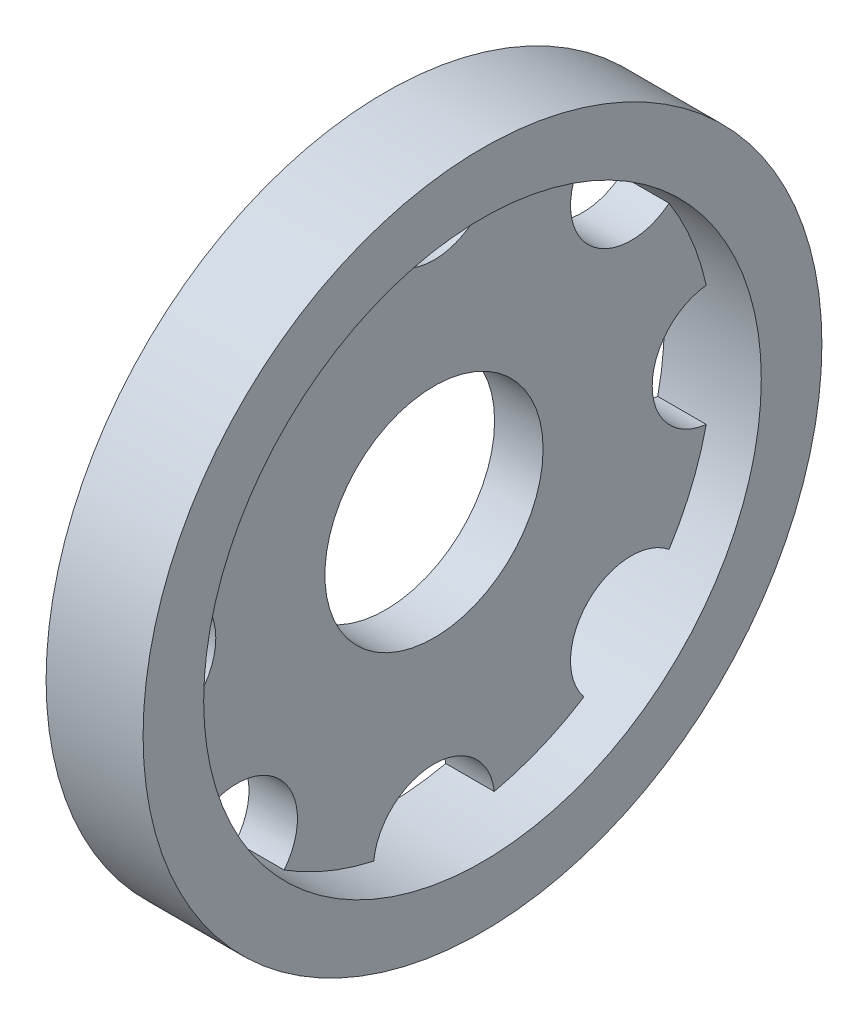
ISO-10303-21;
HEADER;
FILE_DESCRIPTION(('STEP AP214'),'2;1');
FILE_NAME('part.step','',(''),(''),'','','');
FILE_SCHEMA(('AUTOMOTIVE_DESIGN { 1 0 10303 214 1 1 1 1 }'));
ENDSEC;
DATA;
#1=APPLICATION_CONTEXT('core data for automotive mechanical design processes');
#2=APPLICATION_PROTOCOL_DEFINITION('international standard','automotive_design',2000,#1);
#3=PRODUCT_CONTEXT('',#1,'mechanical');
#4=PRODUCT('Part','Part','',(#3));
#5=PRODUCT_RELATED_PRODUCT_CATEGORY('part','',(#4));
#6=PRODUCT_DEFINITION_FORMATION('','',#4);
#7=PRODUCT_DEFINITION_CONTEXT('part definition',#1,'design');
#8=PRODUCT_DEFINITION('design','',#6,#7);
#9=PRODUCT_DEFINITION_SHAPE('','',#8);
#10=(LENGTH_UNIT() NAMED_UNIT(*) SI_UNIT(.MILLI.,.METRE.));
#11=(NAMED_UNIT(*) PLANE_ANGLE_UNIT() SI_UNIT($,.RADIAN.));
#12=(NAMED_UNIT(*) SI_UNIT($,.STERADIAN.) SOLID_ANGLE_UNIT());
#13=UNCERTAINTY_MEASURE_WITH_UNIT(LENGTH_MEASURE(1.E-05),#10,'distance_accuracy_value','');
#14=(GEOMETRIC_REPRESENTATION_CONTEXT(3) GLOBAL_UNCERTAINTY_ASSIGNED_CONTEXT((#13)) GLOBAL_UNIT_ASSIGNED_CONTEXT((#10,
#11,#12)) REPRESENTATION_CONTEXT('',''));
#15=CARTESIAN_POINT('',(0.,0.,0.));
#16=DIRECTION('',(0.,0.,1.));
#17=DIRECTION('',(1.,0.,0.));
#18=AXIS2_PLACEMENT_3D('',#15,#16,#17);
#19=CARTESIAN_POINT('',(2.,8.13172798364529,8.1317279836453));
#20=DIRECTION('',(-1.,0.,0.));
#21=DIRECTION('',(0.,0.,1.));
#22=AXIS2_PLACEMENT_3D('',#19,#20,#21);
#23=CYLINDRICAL_SURFACE('',#22,2.5);
#24=CARTESIAN_POINT('',(0.,8.13172798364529,8.1317279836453));
#25=DIRECTION('',(1.,0.,0.));
#26=DIRECTION('',(0.,0.,-1.));
#27=AXIS2_PLACEMENT_3D('',#24,#25,#26);
#28=CIRCLE('',#27,2.5);
#29=CARTESIAN_POINT('',(0.,6.18228633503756,9.69687246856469));
#30=VERTEX_POINT('',#29);
#31=CARTESIAN_POINT('',(0.,9.69687246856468,6.18228633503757));
#32=VERTEX_POINT('',#31);
#33=EDGE_CURVE('E226',#30,#32,#28,.T.);
#34=ORIENTED_EDGE('',*,*,#33,.F.);
#35=DIRECTION('',(-1.,0.,0.));
#36=VECTOR('',#35,1.);
#37=CARTESIAN_POINT('',(2.,6.18228633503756,9.69687246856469));
#38=LINE('',#37,#36);
#39=CARTESIAN_POINT('',(2.,6.18228633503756,9.69687246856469));
#40=VERTEX_POINT('',#39);
#41=EDGE_CURVE('E11',#40,#30,#38,.T.);
#42=ORIENTED_EDGE('',*,*,#41,.F.);
#43=CARTESIAN_POINT('',(2.,8.13172798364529,8.1317279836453));
#44=DIRECTION('',(1.,0.,0.));
#45=DIRECTION('',(0.,0.,-1.));
#46=AXIS2_PLACEMENT_3D('',#43,#44,#45);
#47=CIRCLE('',#46,2.5);
#48=CARTESIAN_POINT('',(2.,9.69687246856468,6.18228633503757));
#49=VERTEX_POINT('',#48);
#50=EDGE_CURVE('E230',#40,#49,#47,.T.);
#51=ORIENTED_EDGE('',*,*,#50,.T.);
#52=DIRECTION('',(-1.,0.,0.));
#53=VECTOR('',#52,1.);
#54=CARTESIAN_POINT('',(2.,9.69687246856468,6.18228633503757));
#55=LINE('',#54,#53);
#56=EDGE_CURVE('E160',#49,#32,#55,.T.);
#57=ORIENTED_EDGE('',*,*,#56,.T.);
#58=EDGE_LOOP('',(#34,#42,#51,#57));
#59=FACE_BOUND('',#58,.T.);
#60=ADVANCED_FACE('F35',(#59),#23,.F.);
#61=CARTESIAN_POINT('',(2.,0.,11.5));
#62=DIRECTION('',(-1.,0.,0.));
#63=DIRECTION('',(0.,0.,1.));
#64=AXIS2_PLACEMENT_3D('',#61,#62,#63);
#65=CYLINDRICAL_SURFACE('',#64,2.5);
#66=CARTESIAN_POINT('',(0.,0.,11.5));
#67=DIRECTION('',(1.,0.,0.));
#68=DIRECTION('',(0.,0.,-1.));
#69=AXIS2_PLACEMENT_3D('',#66,#67,#68);
#70=CIRCLE('',#69,2.5);
#71=CARTESIAN_POINT('',(0.,-2.48518768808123,11.2282608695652));
#72=VERTEX_POINT('',#71);
#73=CARTESIAN_POINT('',(0.,2.48518768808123,11.2282608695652));
#74=VERTEX_POINT('',#73);
#75=EDGE_CURVE('E199',#72,#74,#70,.T.);
#76=ORIENTED_EDGE('',*,*,#75,.F.);
#77=DIRECTION('',(-1.,0.,0.));
#78=VECTOR('',#77,1.);
#79=CARTESIAN_POINT('',(2.,-2.48518768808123,11.2282608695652));
#80=LINE('',#79,#78);
#81=CARTESIAN_POINT('',(2.,-2.48518768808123,11.2282608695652));
#82=VERTEX_POINT('',#81);
#83=EDGE_CURVE('E189',#82,#72,#80,.T.);
#84=ORIENTED_EDGE('',*,*,#83,.F.);
#85=CARTESIAN_POINT('',(2.,0.,11.5));
#86=DIRECTION('',(1.,0.,0.));
#87=DIRECTION('',(0.,0.,-1.));
#88=AXIS2_PLACEMENT_3D('',#85,#86,#87);
#89=CIRCLE('',#88,2.5);
#90=CARTESIAN_POINT('',(2.,2.48518768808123,11.2282608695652));
#91=VERTEX_POINT('',#90);
#92=EDGE_CURVE('E201',#82,#91,#89,.T.);
#93=ORIENTED_EDGE('',*,*,#92,.T.);
#94=DIRECTION('',(-1.,0.,0.));
#95=VECTOR('',#94,1.);
#96=CARTESIAN_POINT('',(2.,2.48518768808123,11.2282608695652));
#97=LINE('',#96,#95);
#98=EDGE_CURVE('E43',#91,#74,#97,.T.);
#99=ORIENTED_EDGE('',*,*,#98,.T.);
#100=EDGE_LOOP('',(#76,#84,#93,#99));
#101=FACE_BOUND('',#100,.T.);
#102=ADVANCED_FACE('F197',(#101),#65,.F.);
#103=CARTESIAN_POINT('',(2.,-8.1317279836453,8.13172798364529));
#104=DIRECTION('',(-1.,0.,0.));
#105=DIRECTION('',(0.,0.,1.));
#106=AXIS2_PLACEMENT_3D('',#103,#104,#105);
#107=CYLINDRICAL_SURFACE('',#106,2.5);
#108=CARTESIAN_POINT('',(0.,-8.1317279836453,8.13172798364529));
#109=DIRECTION('',(1.,0.,0.));
#110=DIRECTION('',(0.,0.,-1.));
#111=AXIS2_PLACEMENT_3D('',#108,#109,#110);
#112=CIRCLE('',#111,2.5);
#113=CARTESIAN_POINT('',(0.,-9.69687246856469,6.18228633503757));
#114=VERTEX_POINT('',#113);
#115=CARTESIAN_POINT('',(0.,-6.18228633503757,9.69687246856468));
#116=VERTEX_POINT('',#115);
#117=EDGE_CURVE('E258',#114,#116,#112,.T.);
#118=ORIENTED_EDGE('',*,*,#117,.F.);
#119=DIRECTION('',(-1.,0.,0.));
#120=VECTOR('',#119,1.);
#121=CARTESIAN_POINT('',(2.,-9.69687246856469,6.18228633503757));
#122=LINE('',#121,#120);
#123=CARTESIAN_POINT('',(2.,-9.69687246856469,6.18228633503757));
#124=VERTEX_POINT('',#123);
#125=EDGE_CURVE('E183',#124,#114,#122,.T.);
#126=ORIENTED_EDGE('',*,*,#125,.F.);
#127=CARTESIAN_POINT('',(2.,-8.1317279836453,8.13172798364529));
#128=DIRECTION('',(1.,0.,0.));
#129=DIRECTION('',(0.,0.,-1.));
#130=AXIS2_PLACEMENT_3D('',#127,#128,#129);
#131=CIRCLE('',#130,2.5);
#132=CARTESIAN_POINT('',(2.,-6.18228633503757,9.69687246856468));
#133=VERTEX_POINT('',#132);
#134=EDGE_CURVE('E236',#124,#133,#131,.T.);
#135=ORIENTED_EDGE('',*,*,#134,.T.);
#136=DIRECTION('',(-1.,0.,0.));
#137=VECTOR('',#136,1.);
#138=CARTESIAN_POINT('',(2.,-6.18228633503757,9.69687246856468));
#139=LINE('',#138,#137);
#140=EDGE_CURVE('E186',#133,#116,#139,.T.);
#141=ORIENTED_EDGE('',*,*,#140,.T.);
#142=EDGE_LOOP('',(#118,#126,#135,#141));
#143=FACE_BOUND('',#142,.T.);
#144=ADVANCED_FACE('F309',(#143),#107,.F.);
#145=CARTESIAN_POINT('',(2.,-11.5,0.));
#146=DIRECTION('',(-1.,0.,0.));
#147=DIRECTION('',(0.,0.,1.));
#148=AXIS2_PLACEMENT_3D('',#145,#146,#147);
#149=CYLINDRICAL_SURFACE('',#148,2.5);
#150=CARTESIAN_POINT('',(0.,-11.5,0.));
#151=DIRECTION('',(1.,0.,0.));
#152=DIRECTION('',(0.,0.,-1.));
#153=AXIS2_PLACEMENT_3D('',#150,#151,#152);
#154=CIRCLE('',#153,2.5);
#155=CARTESIAN_POINT('',(0.,-11.2282608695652,-2.48518768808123));
#156=VERTEX_POINT('',#155);
#157=CARTESIAN_POINT('',(0.,-11.2282608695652,2.48518768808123));
#158=VERTEX_POINT('',#157);
#159=EDGE_CURVE('E261',#156,#158,#154,.T.);
#160=ORIENTED_EDGE('',*,*,#159,.F.);
#161=DIRECTION('',(-1.,0.,0.));
#162=VECTOR('',#161,1.);
#163=CARTESIAN_POINT('',(2.,-11.2282608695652,-2.48518768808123));
#164=LINE('',#163,#162);
#165=CARTESIAN_POINT('',(2.,-11.2282608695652,-2.48518768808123));
#166=VERTEX_POINT('',#165);
#167=EDGE_CURVE('E177',#166,#156,#164,.T.);
#168=ORIENTED_EDGE('',*,*,#167,.F.);
#169=CARTESIAN_POINT('',(2.,-11.5,0.));
#170=DIRECTION('',(1.,0.,0.));
#171=DIRECTION('',(0.,0.,-1.));
#172=AXIS2_PLACEMENT_3D('',#169,#170,#171);
#173=CIRCLE('',#172,2.5);
#174=CARTESIAN_POINT('',(2.,-11.2282608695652,2.48518768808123));
#175=VERTEX_POINT('',#174);
#176=EDGE_CURVE('E240',#166,#175,#173,.T.);
#177=ORIENTED_EDGE('',*,*,#176,.T.);
#178=DIRECTION('',(-1.,0.,0.));
#179=VECTOR('',#178,1.);
#180=CARTESIAN_POINT('',(2.,-11.2282608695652,2.48518768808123));
#181=LINE('',#180,#179);
#182=EDGE_CURVE('E180',#175,#158,#181,.T.);
#183=ORIENTED_EDGE('',*,*,#182,.T.);
#184=EDGE_LOOP('',(#160,#168,#177,#183));
#185=FACE_BOUND('',#184,.T.);
#186=ADVANCED_FACE('F313',(#185),#149,.F.);
#187=CARTESIAN_POINT('',(2.,-8.13172798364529,-8.1317279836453));
#188=DIRECTION('',(-1.,0.,0.));
#189=DIRECTION('',(0.,0.,1.));
#190=AXIS2_PLACEMENT_3D('',#187,#188,#189);
#191=CYLINDRICAL_SURFACE('',#190,2.5);
#192=CARTESIAN_POINT('',(0.,-8.13172798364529,-8.1317279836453));
#193=DIRECTION('',(1.,0.,0.));
#194=DIRECTION('',(0.,0.,-1.));
#195=AXIS2_PLACEMENT_3D('',#192,#193,#194);
#196=CIRCLE('',#195,2.5);
#197=CARTESIAN_POINT('',(0.,-6.18228633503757,-9.69687246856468));
#198=VERTEX_POINT('',#197);
#199=CARTESIAN_POINT('',(0.,-9.69687246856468,-6.18228633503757));
#200=VERTEX_POINT('',#199);
#201=EDGE_CURVE('E264',#198,#200,#196,.T.);
#202=ORIENTED_EDGE('',*,*,#201,.F.);
#203=DIRECTION('',(-1.,0.,0.));
#204=VECTOR('',#203,1.);
#205=CARTESIAN_POINT('',(2.,-6.18228633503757,-9.69687246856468));
#206=LINE('',#205,#204);
#207=CARTESIAN_POINT('',(2.,-6.18228633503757,-9.69687246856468));
#208=VERTEX_POINT('',#207);
#209=EDGE_CURVE('E171',#208,#198,#206,.T.);
#210=ORIENTED_EDGE('',*,*,#209,.F.);
#211=CARTESIAN_POINT('',(2.,-8.13172798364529,-8.1317279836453));
#212=DIRECTION('',(1.,0.,0.));
#213=DIRECTION('',(0.,0.,-1.));
#214=AXIS2_PLACEMENT_3D('',#211,#212,#213);
#215=CIRCLE('',#214,2.5);
#216=CARTESIAN_POINT('',(2.,-9.69687246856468,-6.18228633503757));
#217=VERTEX_POINT('',#216);
#218=EDGE_CURVE('E244',#208,#217,#215,.T.);
#219=ORIENTED_EDGE('',*,*,#218,.T.);
#220=DIRECTION('',(-1.,0.,0.));
#221=VECTOR('',#220,1.);
#222=CARTESIAN_POINT('',(2.,-9.69687246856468,-6.18228633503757));
#223=LINE('',#222,#221);
#224=EDGE_CURVE('E174',#217,#200,#223,.T.);
#225=ORIENTED_EDGE('',*,*,#224,.T.);
#226=EDGE_LOOP('',(#202,#210,#219,#225));
#227=FACE_BOUND('',#226,.T.);
#228=ADVANCED_FACE('F319',(#227),#191,.F.);
#229=CARTESIAN_POINT('',(2.,0.,-11.5));
#230=DIRECTION('',(-1.,0.,0.));
#231=DIRECTION('',(0.,0.,1.));
#232=AXIS2_PLACEMENT_3D('',#229,#230,#231);
#233=CYLINDRICAL_SURFACE('',#232,2.5);
#234=CARTESIAN_POINT('',(0.,0.,-11.5));
#235=DIRECTION('',(1.,0.,0.));
#236=DIRECTION('',(0.,0.,-1.));
#237=AXIS2_PLACEMENT_3D('',#234,#235,#236);
#238=CIRCLE('',#237,2.5);
#239=CARTESIAN_POINT('',(0.,2.48518768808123,-11.2282608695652));
#240=VERTEX_POINT('',#239);
#241=CARTESIAN_POINT('',(0.,-2.48518768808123,-11.2282608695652));
#242=VERTEX_POINT('',#241);
#243=EDGE_CURVE('E267',#240,#242,#238,.T.);
#244=ORIENTED_EDGE('',*,*,#243,.F.);
#245=DIRECTION('',(-1.,0.,0.));
#246=VECTOR('',#245,1.);
#247=CARTESIAN_POINT('',(2.,2.48518768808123,-11.2282608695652));
#248=LINE('',#247,#246);
#249=CARTESIAN_POINT('',(2.,2.48518768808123,-11.2282608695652));
#250=VERTEX_POINT('',#249);
#251=EDGE_CURVE('E165',#250,#240,#248,.T.);
#252=ORIENTED_EDGE('',*,*,#251,.F.);
#253=CARTESIAN_POINT('',(2.,0.,-11.5));
#254=DIRECTION('',(1.,0.,0.));
#255=DIRECTION('',(0.,0.,-1.));
#256=AXIS2_PLACEMENT_3D('',#253,#254,#255);
#257=CIRCLE('',#256,2.5);
#258=CARTESIAN_POINT('',(2.,-2.48518768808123,-11.2282608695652));
#259=VERTEX_POINT('',#258);
#260=EDGE_CURVE('E248',#250,#259,#257,.T.);
#261=ORIENTED_EDGE('',*,*,#260,.T.);
#262=DIRECTION('',(-1.,0.,0.));
#263=VECTOR('',#262,1.);
#264=CARTESIAN_POINT('',(2.,-2.48518768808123,-11.2282608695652));
#265=LINE('',#264,#263);
#266=EDGE_CURVE('E168',#259,#242,#265,.T.);
#267=ORIENTED_EDGE('',*,*,#266,.T.);
#268=EDGE_LOOP('',(#244,#252,#261,#267));
#269=FACE_BOUND('',#268,.T.);
#270=ADVANCED_FACE('F323',(#269),#233,.F.);
#271=CARTESIAN_POINT('',(2.,8.1317279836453,-8.13172798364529));
#272=DIRECTION('',(-1.,0.,0.));
#273=DIRECTION('',(0.,0.,1.));
#274=AXIS2_PLACEMENT_3D('',#271,#272,#273);
#275=CYLINDRICAL_SURFACE('',#274,2.5);
#276=CARTESIAN_POINT('',(0.,8.1317279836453,-8.13172798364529));
#277=DIRECTION('',(1.,0.,0.));
#278=DIRECTION('',(0.,0.,-1.));
#279=AXIS2_PLACEMENT_3D('',#276,#277,#278);
#280=CIRCLE('',#279,2.5);
#281=CARTESIAN_POINT('',(0.,9.69687246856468,-6.18228633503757));
#282=VERTEX_POINT('',#281);
#283=CARTESIAN_POINT('',(0.,6.18228633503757,-9.69687246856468));
#284=VERTEX_POINT('',#283);
#285=EDGE_CURVE('E82',#282,#284,#280,.T.);
#286=ORIENTED_EDGE('',*,*,#285,.F.);
#287=DIRECTION('',(-1.,0.,0.));
#288=VECTOR('',#287,1.);
#289=CARTESIAN_POINT('',(2.,9.69687246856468,-6.18228633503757));
#290=LINE('',#289,#288);
#291=CARTESIAN_POINT('',(2.,9.69687246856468,-6.18228633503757));
#292=VERTEX_POINT('',#291);
#293=EDGE_CURVE('E156',#292,#282,#290,.T.);
#294=ORIENTED_EDGE('',*,*,#293,.F.);
#295=CARTESIAN_POINT('',(2.,8.1317279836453,-8.13172798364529));
#296=DIRECTION('',(1.,0.,0.));
#297=DIRECTION('',(0.,0.,-1.));
#298=AXIS2_PLACEMENT_3D('',#295,#296,#297);
#299=CIRCLE('',#298,2.5);
#300=CARTESIAN_POINT('',(2.,6.18228633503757,-9.69687246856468));
#301=VERTEX_POINT('',#300);
#302=EDGE_CURVE('E140',#292,#301,#299,.T.);
#303=ORIENTED_EDGE('',*,*,#302,.T.);
#304=DIRECTION('',(-1.,0.,0.));
#305=VECTOR('',#304,1.);
#306=CARTESIAN_POINT('',(2.,6.18228633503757,-9.69687246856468));
#307=LINE('',#306,#305);
#308=EDGE_CURVE('E158',#301,#284,#307,.T.);
#309=ORIENTED_EDGE('',*,*,#308,.T.);
#310=EDGE_LOOP('',(#286,#294,#303,#309));
#311=FACE_BOUND('',#310,.T.);
#312=ADVANCED_FACE('F327',(#311),#275,.F.);
#313=CARTESIAN_POINT('',(2.,11.5,0.));
#314=DIRECTION('',(-1.,0.,0.));
#315=DIRECTION('',(0.,0.,1.));
#316=AXIS2_PLACEMENT_3D('',#313,#314,#315);
#317=CYLINDRICAL_SURFACE('',#316,2.5);
#318=CARTESIAN_POINT('',(0.,11.5,0.));
#319=DIRECTION('',(1.,0.,0.));
#320=DIRECTION('',(0.,0.,-1.));
#321=AXIS2_PLACEMENT_3D('',#318,#319,#320);
#322=CIRCLE('',#321,2.5);
#323=CARTESIAN_POINT('',(0.,11.2282608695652,2.48518768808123));
#324=VERTEX_POINT('',#323);
#325=CARTESIAN_POINT('',(0.,11.2282608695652,-2.48518768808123));
#326=VERTEX_POINT('',#325);
#327=EDGE_CURVE('E89',#324,#326,#322,.T.);
#328=ORIENTED_EDGE('',*,*,#327,.F.);
#329=DIRECTION('',(-1.,0.,0.));
#330=VECTOR('',#329,1.);
#331=CARTESIAN_POINT('',(2.,11.2282608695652,2.48518768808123));
#332=LINE('',#331,#330);
#333=CARTESIAN_POINT('',(2.,11.2282608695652,2.48518768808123));
#334=VERTEX_POINT('',#333);
#335=EDGE_CURVE('E149',#334,#324,#332,.T.);
#336=ORIENTED_EDGE('',*,*,#335,.F.);
#337=CARTESIAN_POINT('',(2.,11.5,0.));
#338=DIRECTION('',(1.,0.,0.));
#339=DIRECTION('',(0.,0.,-1.));
#340=AXIS2_PLACEMENT_3D('',#337,#338,#339);
#341=CIRCLE('',#340,2.5);
#342=CARTESIAN_POINT('',(2.,11.2282608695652,-2.48518768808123));
#343=VERTEX_POINT('',#342);
#344=EDGE_CURVE('E138',#334,#343,#341,.T.);
#345=ORIENTED_EDGE('',*,*,#344,.T.);
#346=DIRECTION('',(-1.,0.,0.));
#347=VECTOR('',#346,1.);
#348=CARTESIAN_POINT('',(2.,11.2282608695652,-2.48518768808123));
#349=LINE('',#348,#347);
#350=EDGE_CURVE('E147',#343,#326,#349,.T.);
#351=ORIENTED_EDGE('',*,*,#350,.T.);
#352=EDGE_LOOP('',(#328,#336,#345,#351));
#353=FACE_BOUND('',#352,.T.);
#354=ADVANCED_FACE('F145',(#353),#317,.F.);
#355=CARTESIAN_POINT('',(2.,0.,0.));
#356=DIRECTION('',(-1.,0.,0.));
#357=DIRECTION('',(0.,0.,1.));
#358=AXIS2_PLACEMENT_3D('',#355,#356,#357);
#359=CYLINDRICAL_SURFACE('',#358,4.5);
#360=CARTESIAN_POINT('',(2.,0.,0.));
#361=DIRECTION('',(1.,0.,0.));
#362=DIRECTION('',(0.,0.,-1.));
#363=AXIS2_PLACEMENT_3D('',#360,#361,#362);
#364=CIRCLE('',#363,4.5);
#365=CARTESIAN_POINT('',(2.,0.,-4.5));
#366=VERTEX_POINT('',#365);
#367=EDGE_CURVE('E252',#366,#366,#364,.T.);
#368=ORIENTED_EDGE('',*,*,#367,.T.);
#369=EDGE_LOOP('',(#368));
#370=FACE_BOUND('',#369,.T.);
#371=CARTESIAN_POINT('',(0.,0.,0.));
#372=DIRECTION('',(1.,0.,0.));
#373=DIRECTION('',(0.,0.,-1.));
#374=AXIS2_PLACEMENT_3D('',#371,#372,#373);
#375=CIRCLE('',#374,4.5);
#376=CARTESIAN_POINT('',(0.,0.,-4.5));
#377=VERTEX_POINT('',#376);
#378=EDGE_CURVE('E232',#377,#377,#375,.T.);
#379=ORIENTED_EDGE('',*,*,#378,.F.);
#380=EDGE_LOOP('',(#379));
#381=FACE_BOUND('',#380,.T.);
#382=ADVANCED_FACE('F333',(#370,#381),#359,.F.);
#383=CARTESIAN_POINT('',(2.,0.,0.));
#384=DIRECTION('',(1.,0.,0.));
#385=DIRECTION('',(0.,0.,-1.));
#386=AXIS2_PLACEMENT_3D('',#383,#384,#385);
#387=PLANE('',#386);
#388=ORIENTED_EDGE('',*,*,#50,.F.);
#389=CARTESIAN_POINT('',(2.,0.,0.));
#390=DIRECTION('',(1.,0.,0.));
#391=DIRECTION('',(0.,0.,-1.));
#392=AXIS2_PLACEMENT_3D('',#389,#390,#391);
#393=CIRCLE('',#392,11.5);
#394=EDGE_CURVE('E231',#40,#91,#393,.T.);
#395=ORIENTED_EDGE('',*,*,#394,.T.);
#396=ORIENTED_EDGE('',*,*,#92,.F.);
#397=EDGE_CURVE('E234',#82,#133,#393,.T.);
#398=ORIENTED_EDGE('',*,*,#397,.T.);
#399=ORIENTED_EDGE('',*,*,#134,.F.);
#400=EDGE_CURVE('E239',#124,#175,#393,.T.);
#401=ORIENTED_EDGE('',*,*,#400,.T.);
#402=ORIENTED_EDGE('',*,*,#176,.F.);
#403=EDGE_CURVE('E243',#166,#217,#393,.T.);
#404=ORIENTED_EDGE('',*,*,#403,.T.);
#405=ORIENTED_EDGE('',*,*,#218,.F.);
#406=EDGE_CURVE('E247',#208,#259,#393,.T.);
#407=ORIENTED_EDGE('',*,*,#406,.T.);
#408=ORIENTED_EDGE('',*,*,#260,.F.);
#409=EDGE_CURVE('E144',#250,#301,#393,.T.);
#410=ORIENTED_EDGE('',*,*,#409,.T.);
#411=ORIENTED_EDGE('',*,*,#302,.F.);
#412=EDGE_CURVE('E134',#292,#343,#393,.T.);
#413=ORIENTED_EDGE('',*,*,#412,.T.);
#414=ORIENTED_EDGE('',*,*,#344,.F.);
#415=EDGE_CURVE('E51',#334,#49,#393,.T.);
#416=ORIENTED_EDGE('',*,*,#415,.T.);
#417=EDGE_LOOP('',(#388,#395,#396,#398,#399,#401,#402,#404,#405,#407,#408,#410,#411,#413,#414,#416));
#418=FACE_BOUND('',#417,.T.);
#419=ORIENTED_EDGE('',*,*,#367,.F.);
#420=EDGE_LOOP('',(#419));
#421=FACE_BOUND('',#420,.T.);
#422=ADVANCED_FACE('F136',(#418,#421),#387,.T.);
#423=CARTESIAN_POINT('',(0.,0.,0.));
#424=DIRECTION('',(1.,0.,0.));
#425=DIRECTION('',(0.,0.,-1.));
#426=AXIS2_PLACEMENT_3D('',#423,#424,#425);
#427=PLANE('',#426);
#428=ORIENTED_EDGE('',*,*,#243,.T.);
#429=CARTESIAN_POINT('',(0.,0.,0.));
#430=DIRECTION('',(1.,0.,0.));
#431=DIRECTION('',(0.,0.,-1.));
#432=AXIS2_PLACEMENT_3D('',#429,#430,#431);
#433=CIRCLE('',#432,11.5);
#434=EDGE_CURVE('E216',#242,#240,#433,.T.);
#435=ORIENTED_EDGE('',*,*,#434,.T.);
#436=EDGE_LOOP('',(#428,#435));
#437=FACE_BOUND('',#436,.T.);
#438=ORIENTED_EDGE('',*,*,#201,.T.);
#439=EDGE_CURVE('E220',#200,#198,#433,.T.);
#440=ORIENTED_EDGE('',*,*,#439,.T.);
#441=EDGE_LOOP('',(#438,#440));
#442=FACE_BOUND('',#441,.T.);
#443=ORIENTED_EDGE('',*,*,#159,.T.);
#444=EDGE_CURVE('E215',#158,#156,#433,.T.);
#445=ORIENTED_EDGE('',*,*,#444,.T.);
#446=EDGE_LOOP('',(#443,#445));
#447=FACE_BOUND('',#446,.T.);
#448=ORIENTED_EDGE('',*,*,#117,.T.);
#449=EDGE_CURVE('E211',#116,#114,#433,.T.);
#450=ORIENTED_EDGE('',*,*,#449,.T.);
#451=EDGE_LOOP('',(#448,#450));
#452=FACE_BOUND('',#451,.T.);
#453=ORIENTED_EDGE('',*,*,#75,.T.);
#454=EDGE_CURVE('E207',#74,#72,#433,.T.);
#455=ORIENTED_EDGE('',*,*,#454,.T.);
#456=EDGE_LOOP('',(#453,#455));
#457=FACE_BOUND('',#456,.T.);
#458=ORIENTED_EDGE('',*,*,#33,.T.);
#459=EDGE_CURVE('E210',#32,#30,#433,.T.);
#460=ORIENTED_EDGE('',*,*,#459,.T.);
#461=EDGE_LOOP('',(#458,#460));
#462=FACE_BOUND('',#461,.T.);
#463=ORIENTED_EDGE('',*,*,#327,.T.);
#464=EDGE_CURVE('E155',#326,#324,#433,.T.);
#465=ORIENTED_EDGE('',*,*,#464,.T.);
#466=EDGE_LOOP('',(#463,#465));
#467=FACE_BOUND('',#466,.T.);
#468=EDGE_CURVE('E221',#284,#282,#433,.T.);
#469=ORIENTED_EDGE('',*,*,#468,.T.);
#470=ORIENTED_EDGE('',*,*,#285,.T.);
#471=EDGE_LOOP('',(#469,#470));
#472=FACE_BOUND('',#471,.T.);
#473=ORIENTED_EDGE('',*,*,#378,.T.);
#474=EDGE_LOOP('',(#473));
#475=FACE_BOUND('',#474,.T.);
#476=CARTESIAN_POINT('',(0.,0.,0.));
#477=DIRECTION('',(1.,0.,0.));
#478=DIRECTION('',(0.,0.,-1.));
#479=AXIS2_PLACEMENT_3D('',#476,#477,#478);
#480=CIRCLE('',#479,14.);
#481=CARTESIAN_POINT('',(0.,0.,-14.));
#482=VERTEX_POINT('',#481);
#483=EDGE_CURVE('E227',#482,#482,#480,.T.);
#484=ORIENTED_EDGE('',*,*,#483,.F.);
#485=EDGE_LOOP('',(#484));
#486=FACE_BOUND('',#485,.T.);
#487=ADVANCED_FACE('F278',(#437,#442,#447,#452,#457,#462,#467,#472,#475,#486),#427,.F.);
#488=CARTESIAN_POINT('',(4.,0.,0.));
#489=DIRECTION('',(1.,0.,0.));
#490=DIRECTION('',(0.,0.,-1.));
#491=AXIS2_PLACEMENT_3D('',#488,#489,#490);
#492=PLANE('',#491);
#493=CARTESIAN_POINT('',(4.,0.,0.));
#494=DIRECTION('',(1.,0.,0.));
#495=DIRECTION('',(0.,0.,-1.));
#496=AXIS2_PLACEMENT_3D('',#493,#494,#495);
#497=CIRCLE('',#496,14.);
#498=CARTESIAN_POINT('',(4.,0.,-14.));
#499=VERTEX_POINT('',#498);
#500=EDGE_CURVE('E223',#499,#499,#497,.T.);
#501=ORIENTED_EDGE('',*,*,#500,.T.);
#502=EDGE_LOOP('',(#501));
#503=FACE_BOUND('',#502,.T.);
#504=CARTESIAN_POINT('',(4.,0.,0.));
#505=DIRECTION('',(1.,0.,0.));
#506=DIRECTION('',(0.,0.,-1.));
#507=AXIS2_PLACEMENT_3D('',#504,#505,#506);
#508=CIRCLE('',#507,11.5);
#509=CARTESIAN_POINT('',(4.,0.,-11.5));
#510=VERTEX_POINT('',#509);
#511=EDGE_CURVE('E222',#510,#510,#508,.T.);
#512=ORIENTED_EDGE('',*,*,#511,.F.);
#513=EDGE_LOOP('',(#512));
#514=FACE_BOUND('',#513,.T.);
#515=ADVANCED_FACE('F281',(#503,#514),#492,.T.);
#516=CARTESIAN_POINT('',(4.,0.,0.));
#517=DIRECTION('',(-1.,0.,0.));
#518=DIRECTION('',(0.,0.,1.));
#519=AXIS2_PLACEMENT_3D('',#516,#517,#518);
#520=CYLINDRICAL_SURFACE('',#519,14.);
#521=ORIENTED_EDGE('',*,*,#500,.F.);
#522=EDGE_LOOP('',(#521));
#523=FACE_BOUND('',#522,.T.);
#524=ORIENTED_EDGE('',*,*,#483,.T.);
#525=EDGE_LOOP('',(#524));
#526=FACE_BOUND('',#525,.T.);
#527=ADVANCED_FACE('F292',(#523,#526),#520,.T.);
#528=CARTESIAN_POINT('',(4.,0.,0.));
#529=DIRECTION('',(-1.,0.,0.));
#530=DIRECTION('',(0.,0.,1.));
#531=AXIS2_PLACEMENT_3D('',#528,#529,#530);
#532=CYLINDRICAL_SURFACE('',#531,11.5);
#533=ORIENTED_EDGE('',*,*,#406,.F.);
#534=ORIENTED_EDGE('',*,*,#209,.T.);
#535=ORIENTED_EDGE('',*,*,#439,.F.);
#536=ORIENTED_EDGE('',*,*,#224,.F.);
#537=ORIENTED_EDGE('',*,*,#403,.F.);
#538=ORIENTED_EDGE('',*,*,#167,.T.);
#539=ORIENTED_EDGE('',*,*,#444,.F.);
#540=ORIENTED_EDGE('',*,*,#182,.F.);
#541=ORIENTED_EDGE('',*,*,#400,.F.);
#542=ORIENTED_EDGE('',*,*,#125,.T.);
#543=ORIENTED_EDGE('',*,*,#449,.F.);
#544=ORIENTED_EDGE('',*,*,#140,.F.);
#545=ORIENTED_EDGE('',*,*,#397,.F.);
#546=ORIENTED_EDGE('',*,*,#83,.T.);
#547=ORIENTED_EDGE('',*,*,#454,.F.);
#548=ORIENTED_EDGE('',*,*,#98,.F.);
#549=ORIENTED_EDGE('',*,*,#394,.F.);
#550=ORIENTED_EDGE('',*,*,#41,.T.);
#551=ORIENTED_EDGE('',*,*,#459,.F.);
#552=ORIENTED_EDGE('',*,*,#56,.F.);
#553=ORIENTED_EDGE('',*,*,#415,.F.);
#554=ORIENTED_EDGE('',*,*,#335,.T.);
#555=ORIENTED_EDGE('',*,*,#464,.F.);
#556=ORIENTED_EDGE('',*,*,#350,.F.);
#557=ORIENTED_EDGE('',*,*,#412,.F.);
#558=ORIENTED_EDGE('',*,*,#293,.T.);
#559=ORIENTED_EDGE('',*,*,#468,.F.);
#560=ORIENTED_EDGE('',*,*,#308,.F.);
#561=ORIENTED_EDGE('',*,*,#409,.F.);
#562=ORIENTED_EDGE('',*,*,#251,.T.);
#563=ORIENTED_EDGE('',*,*,#434,.F.);
#564=ORIENTED_EDGE('',*,*,#266,.F.);
#565=EDGE_LOOP('',(#533,#534,#535,#536,#537,#538,#539,#540,#541,#542,#543,#544,#545,#546,#547,
#548,#549,#550,#551,#552,#553,#554,#555,#556,#557,#558,#559,#560,#561,#562,#563,#564));
#566=FACE_BOUND('',#565,.T.);
#567=ORIENTED_EDGE('',*,*,#511,.T.);
#568=EDGE_LOOP('',(#567));
#569=FACE_BOUND('',#568,.T.);
#570=ADVANCED_FACE('F152',(#566,#569),#532,.F.);
#571=CLOSED_SHELL('',(#60,#102,#144,#186,#228,#270,#312,#354,#382,#422,#487,#515,#527,#570));
#572=MANIFOLD_SOLID_BREP('B2',#571);
#573=ADVANCED_BREP_SHAPE_REPRESENTATION('',(#18,#572),#14);
#574=SHAPE_DEFINITION_REPRESENTATION(#9,#573);
ENDSEC;
END-ISO-10303-21;
